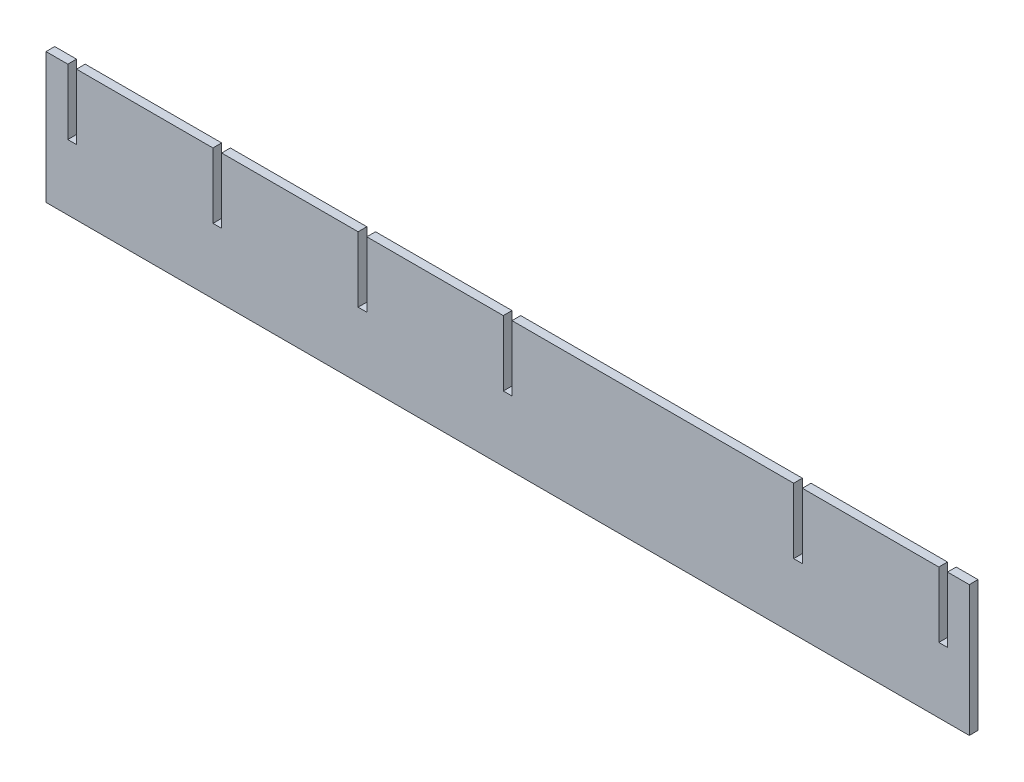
ISO-10303-21;
HEADER;
FILE_DESCRIPTION(('STEP AP214'),'2;1');
FILE_NAME('part.step','',(''),(''),'','','');
FILE_SCHEMA(('AUTOMOTIVE_DESIGN { 1 0 10303 214 1 1 1 1 }'));
ENDSEC;
DATA;
#1=APPLICATION_CONTEXT('core data for automotive mechanical design processes');
#2=APPLICATION_PROTOCOL_DEFINITION('international standard','automotive_design',2000,#1);
#3=PRODUCT_CONTEXT('',#1,'mechanical');
#4=PRODUCT('Part','Part','',(#3));
#5=PRODUCT_RELATED_PRODUCT_CATEGORY('part','',(#4));
#6=PRODUCT_DEFINITION_FORMATION('','',#4);
#7=PRODUCT_DEFINITION_CONTEXT('part definition',#1,'design');
#8=PRODUCT_DEFINITION('design','',#6,#7);
#9=PRODUCT_DEFINITION_SHAPE('','',#8);
#10=(LENGTH_UNIT() NAMED_UNIT(*) SI_UNIT(.MILLI.,.METRE.));
#11=(NAMED_UNIT(*) PLANE_ANGLE_UNIT() SI_UNIT($,.RADIAN.));
#12=(NAMED_UNIT(*) SI_UNIT($,.STERADIAN.) SOLID_ANGLE_UNIT());
#13=UNCERTAINTY_MEASURE_WITH_UNIT(LENGTH_MEASURE(1.E-05),#10,'distance_accuracy_value','');
#14=(GEOMETRIC_REPRESENTATION_CONTEXT(3) GLOBAL_UNCERTAINTY_ASSIGNED_CONTEXT((#13)) GLOBAL_UNIT_ASSIGNED_CONTEXT((#10,
#11,#12)) REPRESENTATION_CONTEXT('',''));
#15=CARTESIAN_POINT('',(0.,0.,0.));
#16=DIRECTION('',(0.,0.,1.));
#17=DIRECTION('',(1.,0.,0.));
#18=AXIS2_PLACEMENT_3D('',#15,#16,#17);
#19=CARTESIAN_POINT('',(0.,90.,12.));
#20=DIRECTION('',(0.,1.,0.));
#21=DIRECTION('',(-1.,0.,0.));
#22=AXIS2_PLACEMENT_3D('',#19,#20,#21);
#23=PLANE('',#22);
#24=DIRECTION('',(1.,0.,0.));
#25=VECTOR('',#24,1.);
#26=CARTESIAN_POINT('',(0.,90.,0.));
#27=LINE('',#26,#25);
#28=CARTESIAN_POINT('',(-594.,90.,0.));
#29=VERTEX_POINT('',#28);
#30=CARTESIAN_POINT('',(-406.,90.,0.));
#31=VERTEX_POINT('',#30);
#32=EDGE_CURVE('E271',#29,#31,#27,.T.);
#33=ORIENTED_EDGE('',*,*,#32,.F.);
#34=DIRECTION('',(0.,0.,-1.));
#35=VECTOR('',#34,1.);
#36=CARTESIAN_POINT('',(-594.,90.,12.));
#37=LINE('',#36,#35);
#38=CARTESIAN_POINT('',(-594.,90.,12.));
#39=VERTEX_POINT('',#38);
#40=EDGE_CURVE('E11',#39,#29,#37,.T.);
#41=ORIENTED_EDGE('',*,*,#40,.F.);
#42=DIRECTION('',(1.,0.,0.));
#43=VECTOR('',#42,1.);
#44=CARTESIAN_POINT('',(0.,90.,12.));
#45=LINE('',#44,#43);
#46=CARTESIAN_POINT('',(-406.,90.,12.));
#47=VERTEX_POINT('',#46);
#48=EDGE_CURVE('E360',#39,#47,#45,.T.);
#49=ORIENTED_EDGE('',*,*,#48,.T.);
#50=DIRECTION('',(0.,0.,-1.));
#51=VECTOR('',#50,1.);
#52=CARTESIAN_POINT('',(-406.,90.,12.));
#53=LINE('',#52,#51);
#54=EDGE_CURVE('E67',#47,#31,#53,.T.);
#55=ORIENTED_EDGE('',*,*,#54,.T.);
#56=EDGE_LOOP('',(#33,#41,#49,#55));
#57=FACE_BOUND('',#56,.T.);
#58=ADVANCED_FACE('F49',(#57),#23,.T.);
#59=CARTESIAN_POINT('',(-594.,0.,12.));
#60=DIRECTION('',(1.,0.,0.));
#61=DIRECTION('',(0.,0.,-1.));
#62=AXIS2_PLACEMENT_3D('',#59,#60,#61);
#63=PLANE('',#62);
#64=DIRECTION('',(0.,-1.,0.));
#65=VECTOR('',#64,1.);
#66=CARTESIAN_POINT('',(-594.,0.,0.));
#67=LINE('',#66,#65);
#68=CARTESIAN_POINT('',(-594.,0.,0.));
#69=VERTEX_POINT('',#68);
#70=EDGE_CURVE('E274',#29,#69,#67,.T.);
#71=ORIENTED_EDGE('',*,*,#70,.T.);
#72=DIRECTION('',(0.,0.,-1.));
#73=VECTOR('',#72,1.);
#74=CARTESIAN_POINT('',(-594.,0.,12.));
#75=LINE('',#74,#73);
#76=CARTESIAN_POINT('',(-594.,0.,12.));
#77=VERTEX_POINT('',#76);
#78=EDGE_CURVE('E59',#77,#69,#75,.T.);
#79=ORIENTED_EDGE('',*,*,#78,.F.);
#80=DIRECTION('',(0.,-1.,0.));
#81=VECTOR('',#80,1.);
#82=CARTESIAN_POINT('',(-594.,0.,12.));
#83=LINE('',#82,#81);
#84=EDGE_CURVE('E457',#39,#77,#83,.T.);
#85=ORIENTED_EDGE('',*,*,#84,.F.);
#86=ORIENTED_EDGE('',*,*,#40,.T.);
#87=EDGE_LOOP('',(#71,#79,#85,#86));
#88=FACE_BOUND('',#87,.T.);
#89=ADVANCED_FACE('F51',(#88),#63,.F.);
#90=CARTESIAN_POINT('',(0.,0.,12.));
#91=DIRECTION('',(0.,1.,0.));
#92=DIRECTION('',(-1.,0.,0.));
#93=AXIS2_PLACEMENT_3D('',#90,#91,#92);
#94=PLANE('',#93);
#95=DIRECTION('',(1.,0.,0.));
#96=VECTOR('',#95,1.);
#97=CARTESIAN_POINT('',(0.,0.,0.));
#98=LINE('',#97,#96);
#99=CARTESIAN_POINT('',(-606.,0.,0.));
#100=VERTEX_POINT('',#99);
#101=EDGE_CURVE('E280',#100,#69,#98,.T.);
#102=ORIENTED_EDGE('',*,*,#101,.F.);
#103=DIRECTION('',(0.,0.,-1.));
#104=VECTOR('',#103,1.);
#105=CARTESIAN_POINT('',(-606.,0.,12.));
#106=LINE('',#105,#104);
#107=CARTESIAN_POINT('',(-606.,0.,12.));
#108=VERTEX_POINT('',#107);
#109=EDGE_CURVE('E431',#108,#100,#106,.T.);
#110=ORIENTED_EDGE('',*,*,#109,.F.);
#111=DIRECTION('',(1.,0.,0.));
#112=VECTOR('',#111,1.);
#113=CARTESIAN_POINT('',(0.,0.,12.));
#114=LINE('',#113,#112);
#115=EDGE_CURVE('E442',#108,#77,#114,.T.);
#116=ORIENTED_EDGE('',*,*,#115,.T.);
#117=ORIENTED_EDGE('',*,*,#78,.T.);
#118=EDGE_LOOP('',(#102,#110,#116,#117));
#119=FACE_BOUND('',#118,.T.);
#120=ADVANCED_FACE('F440',(#119),#94,.T.);
#121=CARTESIAN_POINT('',(-606.,0.,12.));
#122=DIRECTION('',(1.,0.,0.));
#123=DIRECTION('',(0.,0.,-1.));
#124=AXIS2_PLACEMENT_3D('',#121,#122,#123);
#125=PLANE('',#124);
#126=DIRECTION('',(0.,-1.,0.));
#127=VECTOR('',#126,1.);
#128=CARTESIAN_POINT('',(-606.,0.,0.));
#129=LINE('',#128,#127);
#130=CARTESIAN_POINT('',(-606.,90.,0.));
#131=VERTEX_POINT('',#130);
#132=EDGE_CURVE('E284',#131,#100,#129,.T.);
#133=ORIENTED_EDGE('',*,*,#132,.F.);
#134=DIRECTION('',(0.,0.,-1.));
#135=VECTOR('',#134,1.);
#136=CARTESIAN_POINT('',(-606.,90.,12.));
#137=LINE('',#136,#135);
#138=CARTESIAN_POINT('',(-606.,90.,12.));
#139=VERTEX_POINT('',#138);
#140=EDGE_CURVE('E428',#139,#131,#137,.T.);
#141=ORIENTED_EDGE('',*,*,#140,.F.);
#142=DIRECTION('',(0.,-1.,0.));
#143=VECTOR('',#142,1.);
#144=CARTESIAN_POINT('',(-606.,0.,12.));
#145=LINE('',#144,#143);
#146=EDGE_CURVE('E454',#139,#108,#145,.T.);
#147=ORIENTED_EDGE('',*,*,#146,.T.);
#148=ORIENTED_EDGE('',*,*,#109,.T.);
#149=EDGE_LOOP('',(#133,#141,#147,#148));
#150=FACE_BOUND('',#149,.T.);
#151=ADVANCED_FACE('F451',(#150),#125,.T.);
#152=CARTESIAN_POINT('',(-636.,90.,0.));
#153=VERTEX_POINT('',#152);
#154=EDGE_CURVE('E276',#153,#131,#27,.T.);
#155=ORIENTED_EDGE('',*,*,#154,.F.);
#156=DIRECTION('',(0.,0.,-1.));
#157=VECTOR('',#156,1.);
#158=CARTESIAN_POINT('',(-636.,90.,12.));
#159=LINE('',#158,#157);
#160=CARTESIAN_POINT('',(-636.,90.,12.));
#161=VERTEX_POINT('',#160);
#162=EDGE_CURVE('E425',#161,#153,#159,.T.);
#163=ORIENTED_EDGE('',*,*,#162,.F.);
#164=EDGE_CURVE('E464',#161,#139,#45,.T.);
#165=ORIENTED_EDGE('',*,*,#164,.T.);
#166=ORIENTED_EDGE('',*,*,#140,.T.);
#167=EDGE_LOOP('',(#155,#163,#165,#166));
#168=FACE_BOUND('',#167,.T.);
#169=ADVANCED_FACE('F621',(#168),#23,.T.);
#170=CARTESIAN_POINT('',(-636.,0.,12.));
#171=DIRECTION('',(-1.,0.,0.));
#172=DIRECTION('',(0.,0.,1.));
#173=AXIS2_PLACEMENT_3D('',#170,#171,#172);
#174=PLANE('',#173);
#175=DIRECTION('',(0.,1.,0.));
#176=VECTOR('',#175,1.);
#177=CARTESIAN_POINT('',(-636.,0.,0.));
#178=LINE('',#177,#176);
#179=CARTESIAN_POINT('',(-636.,-90.0000000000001,0.));
#180=VERTEX_POINT('',#179);
#181=EDGE_CURVE('E288',#180,#153,#178,.T.);
#182=ORIENTED_EDGE('',*,*,#181,.F.);
#183=DIRECTION('',(0.,0.,-1.));
#184=VECTOR('',#183,1.);
#185=CARTESIAN_POINT('',(-636.,-90.0000000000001,12.));
#186=LINE('',#185,#184);
#187=CARTESIAN_POINT('',(-636.,-90.0000000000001,12.));
#188=VERTEX_POINT('',#187);
#189=EDGE_CURVE('E422',#188,#180,#186,.T.);
#190=ORIENTED_EDGE('',*,*,#189,.F.);
#191=DIRECTION('',(0.,1.,0.));
#192=VECTOR('',#191,1.);
#193=CARTESIAN_POINT('',(-636.,0.,12.));
#194=LINE('',#193,#192);
#195=EDGE_CURVE('E469',#188,#161,#194,.T.);
#196=ORIENTED_EDGE('',*,*,#195,.T.);
#197=ORIENTED_EDGE('',*,*,#162,.T.);
#198=EDGE_LOOP('',(#182,#190,#196,#197));
#199=FACE_BOUND('',#198,.T.);
#200=ADVANCED_FACE('F628',(#199),#174,.T.);
#201=CARTESIAN_POINT('',(0.,-90.,12.));
#202=DIRECTION('',(0.,1.,0.));
#203=DIRECTION('',(-1.,0.,0.));
#204=AXIS2_PLACEMENT_3D('',#201,#202,#203);
#205=PLANE('',#204);
#206=DIRECTION('',(1.,0.,0.));
#207=VECTOR('',#206,1.);
#208=CARTESIAN_POINT('',(0.,-90.,0.));
#209=LINE('',#208,#207);
#210=CARTESIAN_POINT('',(636.,-89.9999999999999,0.));
#211=VERTEX_POINT('',#210);
#212=EDGE_CURVE('E292',#180,#211,#209,.T.);
#213=ORIENTED_EDGE('',*,*,#212,.T.);
#214=DIRECTION('',(0.,0.,-1.));
#215=VECTOR('',#214,1.);
#216=CARTESIAN_POINT('',(636.,-89.9999999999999,12.));
#217=LINE('',#216,#215);
#218=CARTESIAN_POINT('',(636.,-89.9999999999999,12.));
#219=VERTEX_POINT('',#218);
#220=EDGE_CURVE('E418',#219,#211,#217,.T.);
#221=ORIENTED_EDGE('',*,*,#220,.F.);
#222=DIRECTION('',(1.,0.,0.));
#223=VECTOR('',#222,1.);
#224=CARTESIAN_POINT('',(0.,-90.,12.));
#225=LINE('',#224,#223);
#226=EDGE_CURVE('E473',#188,#219,#225,.T.);
#227=ORIENTED_EDGE('',*,*,#226,.F.);
#228=ORIENTED_EDGE('',*,*,#189,.T.);
#229=EDGE_LOOP('',(#213,#221,#227,#228));
#230=FACE_BOUND('',#229,.T.);
#231=ADVANCED_FACE('F799',(#230),#205,.F.);
#232=CARTESIAN_POINT('',(636.,0.,12.));
#233=DIRECTION('',(-1.,0.,0.));
#234=DIRECTION('',(0.,0.,1.));
#235=AXIS2_PLACEMENT_3D('',#232,#233,#234);
#236=PLANE('',#235);
#237=DIRECTION('',(0.,1.,0.));
#238=VECTOR('',#237,1.);
#239=CARTESIAN_POINT('',(636.,0.,0.));
#240=LINE('',#239,#238);
#241=CARTESIAN_POINT('',(636.,90.0000000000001,0.));
#242=VERTEX_POINT('',#241);
#243=EDGE_CURVE('E295',#211,#242,#240,.T.);
#244=ORIENTED_EDGE('',*,*,#243,.T.);
#245=DIRECTION('',(0.,0.,-1.));
#246=VECTOR('',#245,1.);
#247=CARTESIAN_POINT('',(636.,90.0000000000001,12.));
#248=LINE('',#247,#246);
#249=CARTESIAN_POINT('',(636.,90.0000000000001,12.));
#250=VERTEX_POINT('',#249);
#251=EDGE_CURVE('E415',#250,#242,#248,.T.);
#252=ORIENTED_EDGE('',*,*,#251,.F.);
#253=DIRECTION('',(0.,1.,0.));
#254=VECTOR('',#253,1.);
#255=CARTESIAN_POINT('',(636.,0.,12.));
#256=LINE('',#255,#254);
#257=EDGE_CURVE('E476',#219,#250,#256,.T.);
#258=ORIENTED_EDGE('',*,*,#257,.F.);
#259=ORIENTED_EDGE('',*,*,#220,.T.);
#260=EDGE_LOOP('',(#244,#252,#258,#259));
#261=FACE_BOUND('',#260,.T.);
#262=ADVANCED_FACE('F792',(#261),#236,.F.);
#263=CARTESIAN_POINT('',(606.,90.0000000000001,0.));
#264=VERTEX_POINT('',#263);
#265=EDGE_CURVE('E299',#264,#242,#27,.T.);
#266=ORIENTED_EDGE('',*,*,#265,.F.);
#267=DIRECTION('',(0.,0.,-1.));
#268=VECTOR('',#267,1.);
#269=CARTESIAN_POINT('',(606.,90.0000000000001,12.));
#270=LINE('',#269,#268);
#271=CARTESIAN_POINT('',(606.,90.0000000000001,12.));
#272=VERTEX_POINT('',#271);
#273=EDGE_CURVE('E412',#272,#264,#270,.T.);
#274=ORIENTED_EDGE('',*,*,#273,.F.);
#275=EDGE_CURVE('E479',#272,#250,#45,.T.);
#276=ORIENTED_EDGE('',*,*,#275,.T.);
#277=ORIENTED_EDGE('',*,*,#251,.T.);
#278=EDGE_LOOP('',(#266,#274,#276,#277));
#279=FACE_BOUND('',#278,.T.);
#280=ADVANCED_FACE('F629',(#279),#23,.T.);
#281=CARTESIAN_POINT('',(606.,0.,12.));
#282=DIRECTION('',(1.,0.,0.));
#283=DIRECTION('',(0.,0.,-1.));
#284=AXIS2_PLACEMENT_3D('',#281,#282,#283);
#285=PLANE('',#284);
#286=DIRECTION('',(0.,-1.,0.));
#287=VECTOR('',#286,1.);
#288=CARTESIAN_POINT('',(606.,0.,0.));
#289=LINE('',#288,#287);
#290=CARTESIAN_POINT('',(606.,0.,0.));
#291=VERTEX_POINT('',#290);
#292=EDGE_CURVE('E300',#264,#291,#289,.T.);
#293=ORIENTED_EDGE('',*,*,#292,.T.);
#294=DIRECTION('',(0.,0.,-1.));
#295=VECTOR('',#294,1.);
#296=CARTESIAN_POINT('',(606.,0.,12.));
#297=LINE('',#296,#295);
#298=CARTESIAN_POINT('',(606.,0.,12.));
#299=VERTEX_POINT('',#298);
#300=EDGE_CURVE('E409',#299,#291,#297,.T.);
#301=ORIENTED_EDGE('',*,*,#300,.F.);
#302=DIRECTION('',(0.,-1.,0.));
#303=VECTOR('',#302,1.);
#304=CARTESIAN_POINT('',(606.,0.,12.));
#305=LINE('',#304,#303);
#306=EDGE_CURVE('E480',#272,#299,#305,.T.);
#307=ORIENTED_EDGE('',*,*,#306,.F.);
#308=ORIENTED_EDGE('',*,*,#273,.T.);
#309=EDGE_LOOP('',(#293,#301,#307,#308));
#310=FACE_BOUND('',#309,.T.);
#311=ADVANCED_FACE('F775',(#310),#285,.F.);
#312=CARTESIAN_POINT('',(0.,0.,12.));
#313=DIRECTION('',(0.,1.,0.));
#314=DIRECTION('',(-1.,0.,0.));
#315=AXIS2_PLACEMENT_3D('',#312,#313,#314);
#316=PLANE('',#315);
#317=DIRECTION('',(1.,0.,0.));
#318=VECTOR('',#317,1.);
#319=CARTESIAN_POINT('',(0.,0.,0.));
#320=LINE('',#319,#318);
#321=CARTESIAN_POINT('',(594.,0.,0.));
#322=VERTEX_POINT('',#321);
#323=EDGE_CURVE('E304',#322,#291,#320,.T.);
#324=ORIENTED_EDGE('',*,*,#323,.F.);
#325=DIRECTION('',(0.,0.,-1.));
#326=VECTOR('',#325,1.);
#327=CARTESIAN_POINT('',(594.,0.,12.));
#328=LINE('',#327,#326);
#329=CARTESIAN_POINT('',(594.,0.,12.));
#330=VERTEX_POINT('',#329);
#331=EDGE_CURVE('E406',#330,#322,#328,.T.);
#332=ORIENTED_EDGE('',*,*,#331,.F.);
#333=DIRECTION('',(1.,0.,0.));
#334=VECTOR('',#333,1.);
#335=CARTESIAN_POINT('',(0.,0.,12.));
#336=LINE('',#335,#334);
#337=EDGE_CURVE('E483',#330,#299,#336,.T.);
#338=ORIENTED_EDGE('',*,*,#337,.T.);
#339=ORIENTED_EDGE('',*,*,#300,.T.);
#340=EDGE_LOOP('',(#324,#332,#338,#339));
#341=FACE_BOUND('',#340,.T.);
#342=ADVANCED_FACE('F766',(#341),#316,.T.);
#343=CARTESIAN_POINT('',(594.,0.,12.));
#344=DIRECTION('',(1.,0.,0.));
#345=DIRECTION('',(0.,0.,-1.));
#346=AXIS2_PLACEMENT_3D('',#343,#344,#345);
#347=PLANE('',#346);
#348=DIRECTION('',(0.,-1.,0.));
#349=VECTOR('',#348,1.);
#350=CARTESIAN_POINT('',(594.,0.,0.));
#351=LINE('',#350,#349);
#352=CARTESIAN_POINT('',(594.,90.0000000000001,0.));
#353=VERTEX_POINT('',#352);
#354=EDGE_CURVE('E308',#353,#322,#351,.T.);
#355=ORIENTED_EDGE('',*,*,#354,.F.);
#356=DIRECTION('',(0.,0.,-1.));
#357=VECTOR('',#356,1.);
#358=CARTESIAN_POINT('',(594.,90.0000000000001,12.));
#359=LINE('',#358,#357);
#360=CARTESIAN_POINT('',(594.,90.0000000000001,12.));
#361=VERTEX_POINT('',#360);
#362=EDGE_CURVE('E403',#361,#353,#359,.T.);
#363=ORIENTED_EDGE('',*,*,#362,.F.);
#364=DIRECTION('',(0.,-1.,0.));
#365=VECTOR('',#364,1.);
#366=CARTESIAN_POINT('',(594.,0.,12.));
#367=LINE('',#366,#365);
#368=EDGE_CURVE('E487',#361,#330,#367,.T.);
#369=ORIENTED_EDGE('',*,*,#368,.T.);
#370=ORIENTED_EDGE('',*,*,#331,.T.);
#371=EDGE_LOOP('',(#355,#363,#369,#370));
#372=FACE_BOUND('',#371,.T.);
#373=ADVANCED_FACE('F759',(#372),#347,.T.);
#374=CARTESIAN_POINT('',(406.,90.0000000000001,0.));
#375=VERTEX_POINT('',#374);
#376=EDGE_CURVE('E312',#375,#353,#27,.T.);
#377=ORIENTED_EDGE('',*,*,#376,.F.);
#378=DIRECTION('',(0.,0.,-1.));
#379=VECTOR('',#378,1.);
#380=CARTESIAN_POINT('',(406.,90.0000000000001,12.));
#381=LINE('',#380,#379);
#382=CARTESIAN_POINT('',(406.,90.0000000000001,12.));
#383=VERTEX_POINT('',#382);
#384=EDGE_CURVE('E400',#383,#375,#381,.T.);
#385=ORIENTED_EDGE('',*,*,#384,.F.);
#386=EDGE_CURVE('E491',#383,#361,#45,.T.);
#387=ORIENTED_EDGE('',*,*,#386,.T.);
#388=ORIENTED_EDGE('',*,*,#362,.T.);
#389=EDGE_LOOP('',(#377,#385,#387,#388));
#390=FACE_BOUND('',#389,.T.);
#391=ADVANCED_FACE('F618',(#390),#23,.T.);
#392=CARTESIAN_POINT('',(406.,0.,12.));
#393=DIRECTION('',(1.,0.,0.));
#394=DIRECTION('',(0.,0.,-1.));
#395=AXIS2_PLACEMENT_3D('',#392,#393,#394);
#396=PLANE('',#395);
#397=DIRECTION('',(0.,-1.,0.));
#398=VECTOR('',#397,1.);
#399=CARTESIAN_POINT('',(406.,0.,0.));
#400=LINE('',#399,#398);
#401=CARTESIAN_POINT('',(406.,0.,0.));
#402=VERTEX_POINT('',#401);
#403=EDGE_CURVE('E313',#375,#402,#400,.T.);
#404=ORIENTED_EDGE('',*,*,#403,.T.);
#405=DIRECTION('',(0.,0.,-1.));
#406=VECTOR('',#405,1.);
#407=CARTESIAN_POINT('',(406.,0.,12.));
#408=LINE('',#407,#406);
#409=CARTESIAN_POINT('',(406.,0.,12.));
#410=VERTEX_POINT('',#409);
#411=EDGE_CURVE('E397',#410,#402,#408,.T.);
#412=ORIENTED_EDGE('',*,*,#411,.F.);
#413=DIRECTION('',(0.,-1.,0.));
#414=VECTOR('',#413,1.);
#415=CARTESIAN_POINT('',(406.,0.,12.));
#416=LINE('',#415,#414);
#417=EDGE_CURVE('E492',#383,#410,#416,.T.);
#418=ORIENTED_EDGE('',*,*,#417,.F.);
#419=ORIENTED_EDGE('',*,*,#384,.T.);
#420=EDGE_LOOP('',(#404,#412,#418,#419));
#421=FACE_BOUND('',#420,.T.);
#422=ADVANCED_FACE('F742',(#421),#396,.F.);
#423=CARTESIAN_POINT('',(0.,0.,12.));
#424=DIRECTION('',(0.,1.,0.));
#425=DIRECTION('',(-1.,0.,0.));
#426=AXIS2_PLACEMENT_3D('',#423,#424,#425);
#427=PLANE('',#426);
#428=DIRECTION('',(1.,0.,0.));
#429=VECTOR('',#428,1.);
#430=CARTESIAN_POINT('',(0.,0.,0.));
#431=LINE('',#430,#429);
#432=CARTESIAN_POINT('',(394.,0.,0.));
#433=VERTEX_POINT('',#432);
#434=EDGE_CURVE('E317',#433,#402,#431,.T.);
#435=ORIENTED_EDGE('',*,*,#434,.F.);
#436=DIRECTION('',(0.,0.,-1.));
#437=VECTOR('',#436,1.);
#438=CARTESIAN_POINT('',(394.,0.,12.));
#439=LINE('',#438,#437);
#440=CARTESIAN_POINT('',(394.,0.,12.));
#441=VERTEX_POINT('',#440);
#442=EDGE_CURVE('E394',#441,#433,#439,.T.);
#443=ORIENTED_EDGE('',*,*,#442,.F.);
#444=DIRECTION('',(1.,0.,0.));
#445=VECTOR('',#444,1.);
#446=CARTESIAN_POINT('',(0.,0.,12.));
#447=LINE('',#446,#445);
#448=EDGE_CURVE('E495',#441,#410,#447,.T.);
#449=ORIENTED_EDGE('',*,*,#448,.T.);
#450=ORIENTED_EDGE('',*,*,#411,.T.);
#451=EDGE_LOOP('',(#435,#443,#449,#450));
#452=FACE_BOUND('',#451,.T.);
#453=ADVANCED_FACE('F735',(#452),#427,.T.);
#454=CARTESIAN_POINT('',(394.,0.,12.));
#455=DIRECTION('',(1.,0.,0.));
#456=DIRECTION('',(0.,0.,-1.));
#457=AXIS2_PLACEMENT_3D('',#454,#455,#456);
#458=PLANE('',#457);
#459=DIRECTION('',(0.,-1.,0.));
#460=VECTOR('',#459,1.);
#461=CARTESIAN_POINT('',(394.,0.,0.));
#462=LINE('',#461,#460);
#463=CARTESIAN_POINT('',(394.,90.0000000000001,0.));
#464=VERTEX_POINT('',#463);
#465=EDGE_CURVE('E321',#464,#433,#462,.T.);
#466=ORIENTED_EDGE('',*,*,#465,.F.);
#467=DIRECTION('',(0.,0.,-1.));
#468=VECTOR('',#467,1.);
#469=CARTESIAN_POINT('',(394.,90.0000000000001,12.));
#470=LINE('',#469,#468);
#471=CARTESIAN_POINT('',(394.,90.0000000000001,12.));
#472=VERTEX_POINT('',#471);
#473=EDGE_CURVE('E391',#472,#464,#470,.T.);
#474=ORIENTED_EDGE('',*,*,#473,.F.);
#475=DIRECTION('',(0.,-1.,0.));
#476=VECTOR('',#475,1.);
#477=CARTESIAN_POINT('',(394.,0.,12.));
#478=LINE('',#477,#476);
#479=EDGE_CURVE('E499',#472,#441,#478,.T.);
#480=ORIENTED_EDGE('',*,*,#479,.T.);
#481=ORIENTED_EDGE('',*,*,#442,.T.);
#482=EDGE_LOOP('',(#466,#474,#480,#481));
#483=FACE_BOUND('',#482,.T.);
#484=ADVANCED_FACE('F568',(#483),#458,.T.);
#485=CARTESIAN_POINT('',(5.99999999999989,90.,0.));
#486=VERTEX_POINT('',#485);
#487=EDGE_CURVE('E325',#486,#464,#27,.T.);
#488=ORIENTED_EDGE('',*,*,#487,.F.);
#489=DIRECTION('',(0.,0.,-1.));
#490=VECTOR('',#489,1.);
#491=CARTESIAN_POINT('',(5.99999999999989,90.,12.));
#492=LINE('',#491,#490);
#493=CARTESIAN_POINT('',(5.99999999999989,90.,12.));
#494=VERTEX_POINT('',#493);
#495=EDGE_CURVE('E388',#494,#486,#492,.T.);
#496=ORIENTED_EDGE('',*,*,#495,.F.);
#497=EDGE_CURVE('E503',#494,#472,#45,.T.);
#498=ORIENTED_EDGE('',*,*,#497,.T.);
#499=ORIENTED_EDGE('',*,*,#473,.T.);
#500=EDGE_LOOP('',(#488,#496,#498,#499));
#501=FACE_BOUND('',#500,.T.);
#502=ADVANCED_FACE('F560',(#501),#23,.T.);
#503=CARTESIAN_POINT('',(5.99999999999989,0.,12.));
#504=DIRECTION('',(1.,0.,0.));
#505=DIRECTION('',(0.,0.,-1.));
#506=AXIS2_PLACEMENT_3D('',#503,#504,#505);
#507=PLANE('',#506);
#508=DIRECTION('',(0.,-1.,0.));
#509=VECTOR('',#508,1.);
#510=CARTESIAN_POINT('',(5.99999999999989,0.,0.));
#511=LINE('',#510,#509);
#512=CARTESIAN_POINT('',(5.99999999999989,0.,0.));
#513=VERTEX_POINT('',#512);
#514=EDGE_CURVE('E326',#486,#513,#511,.T.);
#515=ORIENTED_EDGE('',*,*,#514,.T.);
#516=DIRECTION('',(0.,0.,-1.));
#517=VECTOR('',#516,1.);
#518=CARTESIAN_POINT('',(5.99999999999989,0.,12.));
#519=LINE('',#518,#517);
#520=CARTESIAN_POINT('',(5.99999999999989,0.,12.));
#521=VERTEX_POINT('',#520);
#522=EDGE_CURVE('E385',#521,#513,#519,.T.);
#523=ORIENTED_EDGE('',*,*,#522,.F.);
#524=DIRECTION('',(0.,-1.,0.));
#525=VECTOR('',#524,1.);
#526=CARTESIAN_POINT('',(5.99999999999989,0.,12.));
#527=LINE('',#526,#525);
#528=EDGE_CURVE('E504',#494,#521,#527,.T.);
#529=ORIENTED_EDGE('',*,*,#528,.F.);
#530=ORIENTED_EDGE('',*,*,#495,.T.);
#531=EDGE_LOOP('',(#515,#523,#529,#530));
#532=FACE_BOUND('',#531,.T.);
#533=ADVANCED_FACE('F609',(#532),#507,.F.);
#534=CARTESIAN_POINT('',(0.,0.,12.));
#535=DIRECTION('',(0.,1.,0.));
#536=DIRECTION('',(-1.,0.,0.));
#537=AXIS2_PLACEMENT_3D('',#534,#535,#536);
#538=PLANE('',#537);
#539=DIRECTION('',(1.,0.,0.));
#540=VECTOR('',#539,1.);
#541=CARTESIAN_POINT('',(0.,0.,0.));
#542=LINE('',#541,#540);
#543=CARTESIAN_POINT('',(-6.00000000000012,0.,0.));
#544=VERTEX_POINT('',#543);
#545=EDGE_CURVE('E330',#544,#513,#542,.T.);
#546=ORIENTED_EDGE('',*,*,#545,.F.);
#547=DIRECTION('',(0.,0.,-1.));
#548=VECTOR('',#547,1.);
#549=CARTESIAN_POINT('',(-6.00000000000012,0.,12.));
#550=LINE('',#549,#548);
#551=CARTESIAN_POINT('',(-6.00000000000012,0.,12.));
#552=VERTEX_POINT('',#551);
#553=EDGE_CURVE('E382',#552,#544,#550,.T.);
#554=ORIENTED_EDGE('',*,*,#553,.F.);
#555=DIRECTION('',(1.,0.,0.));
#556=VECTOR('',#555,1.);
#557=CARTESIAN_POINT('',(0.,0.,12.));
#558=LINE('',#557,#556);
#559=EDGE_CURVE('E507',#552,#521,#558,.T.);
#560=ORIENTED_EDGE('',*,*,#559,.T.);
#561=ORIENTED_EDGE('',*,*,#522,.T.);
#562=EDGE_LOOP('',(#546,#554,#560,#561));
#563=FACE_BOUND('',#562,.T.);
#564=ADVANCED_FACE('F607',(#563),#538,.T.);
#565=CARTESIAN_POINT('',(-6.00000000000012,0.,12.));
#566=DIRECTION('',(1.,0.,0.));
#567=DIRECTION('',(0.,0.,-1.));
#568=AXIS2_PLACEMENT_3D('',#565,#566,#567);
#569=PLANE('',#568);
#570=DIRECTION('',(0.,-1.,0.));
#571=VECTOR('',#570,1.);
#572=CARTESIAN_POINT('',(-6.00000000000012,0.,0.));
#573=LINE('',#572,#571);
#574=CARTESIAN_POINT('',(-6.00000000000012,90.,0.));
#575=VERTEX_POINT('',#574);
#576=EDGE_CURVE('E334',#575,#544,#573,.T.);
#577=ORIENTED_EDGE('',*,*,#576,.F.);
#578=DIRECTION('',(0.,0.,-1.));
#579=VECTOR('',#578,1.);
#580=CARTESIAN_POINT('',(-6.00000000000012,90.,12.));
#581=LINE('',#580,#579);
#582=CARTESIAN_POINT('',(-6.00000000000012,90.,12.));
#583=VERTEX_POINT('',#582);
#584=EDGE_CURVE('E379',#583,#575,#581,.T.);
#585=ORIENTED_EDGE('',*,*,#584,.F.);
#586=DIRECTION('',(0.,-1.,0.));
#587=VECTOR('',#586,1.);
#588=CARTESIAN_POINT('',(-6.00000000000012,0.,12.));
#589=LINE('',#588,#587);
#590=EDGE_CURVE('E511',#583,#552,#589,.T.);
#591=ORIENTED_EDGE('',*,*,#590,.T.);
#592=ORIENTED_EDGE('',*,*,#553,.T.);
#593=EDGE_LOOP('',(#577,#585,#591,#592));
#594=FACE_BOUND('',#593,.T.);
#595=ADVANCED_FACE('F604',(#594),#569,.T.);
#596=CARTESIAN_POINT('',(-194.,90.,0.));
#597=VERTEX_POINT('',#596);
#598=EDGE_CURVE('E338',#597,#575,#27,.T.);
#599=ORIENTED_EDGE('',*,*,#598,.F.);
#600=DIRECTION('',(0.,0.,-1.));
#601=VECTOR('',#600,1.);
#602=CARTESIAN_POINT('',(-194.,90.,12.));
#603=LINE('',#602,#601);
#604=CARTESIAN_POINT('',(-194.,90.,12.));
#605=VERTEX_POINT('',#604);
#606=EDGE_CURVE('E376',#605,#597,#603,.T.);
#607=ORIENTED_EDGE('',*,*,#606,.F.);
#608=EDGE_CURVE('E515',#605,#583,#45,.T.);
#609=ORIENTED_EDGE('',*,*,#608,.T.);
#610=ORIENTED_EDGE('',*,*,#584,.T.);
#611=EDGE_LOOP('',(#599,#607,#609,#610));
#612=FACE_BOUND('',#611,.T.);
#613=ADVANCED_FACE('F598',(#612),#23,.T.);
#614=CARTESIAN_POINT('',(-194.,0.,12.));
#615=DIRECTION('',(1.,0.,0.));
#616=DIRECTION('',(0.,0.,-1.));
#617=AXIS2_PLACEMENT_3D('',#614,#615,#616);
#618=PLANE('',#617);
#619=DIRECTION('',(0.,-1.,0.));
#620=VECTOR('',#619,1.);
#621=CARTESIAN_POINT('',(-194.,0.,0.));
#622=LINE('',#621,#620);
#623=CARTESIAN_POINT('',(-194.,0.,0.));
#624=VERTEX_POINT('',#623);
#625=EDGE_CURVE('E339',#597,#624,#622,.T.);
#626=ORIENTED_EDGE('',*,*,#625,.T.);
#627=DIRECTION('',(0.,0.,-1.));
#628=VECTOR('',#627,1.);
#629=CARTESIAN_POINT('',(-194.,0.,12.));
#630=LINE('',#629,#628);
#631=CARTESIAN_POINT('',(-194.,0.,12.));
#632=VERTEX_POINT('',#631);
#633=EDGE_CURVE('E373',#632,#624,#630,.T.);
#634=ORIENTED_EDGE('',*,*,#633,.F.);
#635=DIRECTION('',(0.,-1.,0.));
#636=VECTOR('',#635,1.);
#637=CARTESIAN_POINT('',(-194.,0.,12.));
#638=LINE('',#637,#636);
#639=EDGE_CURVE('E516',#605,#632,#638,.T.);
#640=ORIENTED_EDGE('',*,*,#639,.F.);
#641=ORIENTED_EDGE('',*,*,#606,.T.);
#642=EDGE_LOOP('',(#626,#634,#640,#641));
#643=FACE_BOUND('',#642,.T.);
#644=ADVANCED_FACE('F636',(#643),#618,.F.);
#645=CARTESIAN_POINT('',(0.,0.,12.));
#646=DIRECTION('',(0.,1.,0.));
#647=DIRECTION('',(-1.,0.,0.));
#648=AXIS2_PLACEMENT_3D('',#645,#646,#647);
#649=PLANE('',#648);
#650=DIRECTION('',(1.,0.,0.));
#651=VECTOR('',#650,1.);
#652=CARTESIAN_POINT('',(0.,0.,0.));
#653=LINE('',#652,#651);
#654=CARTESIAN_POINT('',(-206.,0.,0.));
#655=VERTEX_POINT('',#654);
#656=EDGE_CURVE('E343',#655,#624,#653,.T.);
#657=ORIENTED_EDGE('',*,*,#656,.F.);
#658=DIRECTION('',(0.,0.,-1.));
#659=VECTOR('',#658,1.);
#660=CARTESIAN_POINT('',(-206.,0.,12.));
#661=LINE('',#660,#659);
#662=CARTESIAN_POINT('',(-206.,0.,12.));
#663=VERTEX_POINT('',#662);
#664=EDGE_CURVE('E370',#663,#655,#661,.T.);
#665=ORIENTED_EDGE('',*,*,#664,.F.);
#666=DIRECTION('',(1.,0.,0.));
#667=VECTOR('',#666,1.);
#668=CARTESIAN_POINT('',(0.,0.,12.));
#669=LINE('',#668,#667);
#670=EDGE_CURVE('E519',#663,#632,#669,.T.);
#671=ORIENTED_EDGE('',*,*,#670,.T.);
#672=ORIENTED_EDGE('',*,*,#633,.T.);
#673=EDGE_LOOP('',(#657,#665,#671,#672));
#674=FACE_BOUND('',#673,.T.);
#675=ADVANCED_FACE('F594',(#674),#649,.T.);
#676=CARTESIAN_POINT('',(-206.,0.,12.));
#677=DIRECTION('',(1.,0.,0.));
#678=DIRECTION('',(0.,0.,-1.));
#679=AXIS2_PLACEMENT_3D('',#676,#677,#678);
#680=PLANE('',#679);
#681=DIRECTION('',(0.,-1.,0.));
#682=VECTOR('',#681,1.);
#683=CARTESIAN_POINT('',(-206.,0.,0.));
#684=LINE('',#683,#682);
#685=CARTESIAN_POINT('',(-206.,90.,0.));
#686=VERTEX_POINT('',#685);
#687=EDGE_CURVE('E347',#686,#655,#684,.T.);
#688=ORIENTED_EDGE('',*,*,#687,.F.);
#689=DIRECTION('',(0.,0.,-1.));
#690=VECTOR('',#689,1.);
#691=CARTESIAN_POINT('',(-206.,90.,12.));
#692=LINE('',#691,#690);
#693=CARTESIAN_POINT('',(-206.,90.,12.));
#694=VERTEX_POINT('',#693);
#695=EDGE_CURVE('E367',#694,#686,#692,.T.);
#696=ORIENTED_EDGE('',*,*,#695,.F.);
#697=DIRECTION('',(0.,-1.,0.));
#698=VECTOR('',#697,1.);
#699=CARTESIAN_POINT('',(-206.,0.,12.));
#700=LINE('',#699,#698);
#701=EDGE_CURVE('E522',#694,#663,#700,.T.);
#702=ORIENTED_EDGE('',*,*,#701,.T.);
#703=ORIENTED_EDGE('',*,*,#664,.T.);
#704=EDGE_LOOP('',(#688,#696,#702,#703));
#705=FACE_BOUND('',#704,.T.);
#706=ADVANCED_FACE('F590',(#705),#680,.T.);
#707=CARTESIAN_POINT('',(-394.,90.,0.));
#708=VERTEX_POINT('',#707);
#709=EDGE_CURVE('E275',#708,#686,#27,.T.);
#710=ORIENTED_EDGE('',*,*,#709,.F.);
#711=DIRECTION('',(0.,0.,-1.));
#712=VECTOR('',#711,1.);
#713=CARTESIAN_POINT('',(-394.,90.,12.));
#714=LINE('',#713,#712);
#715=CARTESIAN_POINT('',(-394.,90.,12.));
#716=VERTEX_POINT('',#715);
#717=EDGE_CURVE('E259',#716,#708,#714,.T.);
#718=ORIENTED_EDGE('',*,*,#717,.F.);
#719=EDGE_CURVE('E247',#716,#694,#45,.T.);
#720=ORIENTED_EDGE('',*,*,#719,.T.);
#721=ORIENTED_EDGE('',*,*,#695,.T.);
#722=EDGE_LOOP('',(#710,#718,#720,#721));
#723=FACE_BOUND('',#722,.T.);
#724=ADVANCED_FACE('F589',(#723),#23,.T.);
#725=CARTESIAN_POINT('',(-394.,0.,12.));
#726=DIRECTION('',(1.,0.,0.));
#727=DIRECTION('',(0.,0.,-1.));
#728=AXIS2_PLACEMENT_3D('',#725,#726,#727);
#729=PLANE('',#728);
#730=DIRECTION('',(0.,-1.,0.));
#731=VECTOR('',#730,1.);
#732=CARTESIAN_POINT('',(-394.,0.,0.));
#733=LINE('',#732,#731);
#734=CARTESIAN_POINT('',(-394.,0.,0.));
#735=VERTEX_POINT('',#734);
#736=EDGE_CURVE('E255',#708,#735,#733,.T.);
#737=ORIENTED_EDGE('',*,*,#736,.T.);
#738=DIRECTION('',(0.,0.,-1.));
#739=VECTOR('',#738,1.);
#740=CARTESIAN_POINT('',(-394.,0.,12.));
#741=LINE('',#740,#739);
#742=CARTESIAN_POINT('',(-394.,0.,12.));
#743=VERTEX_POINT('',#742);
#744=EDGE_CURVE('E252',#743,#735,#741,.T.);
#745=ORIENTED_EDGE('',*,*,#744,.F.);
#746=DIRECTION('',(0.,-1.,0.));
#747=VECTOR('',#746,1.);
#748=CARTESIAN_POINT('',(-394.,0.,12.));
#749=LINE('',#748,#747);
#750=EDGE_CURVE('E238',#716,#743,#749,.T.);
#751=ORIENTED_EDGE('',*,*,#750,.F.);
#752=ORIENTED_EDGE('',*,*,#717,.T.);
#753=EDGE_LOOP('',(#737,#745,#751,#752));
#754=FACE_BOUND('',#753,.T.);
#755=ADVANCED_FACE('F253',(#754),#729,.F.);
#756=CARTESIAN_POINT('',(0.,0.,12.));
#757=DIRECTION('',(0.,1.,0.));
#758=DIRECTION('',(-1.,0.,0.));
#759=AXIS2_PLACEMENT_3D('',#756,#757,#758);
#760=PLANE('',#759);
#761=DIRECTION('',(1.,0.,0.));
#762=VECTOR('',#761,1.);
#763=CARTESIAN_POINT('',(0.,0.,0.));
#764=LINE('',#763,#762);
#765=CARTESIAN_POINT('',(-406.,0.,0.));
#766=VERTEX_POINT('',#765);
#767=EDGE_CURVE('E353',#766,#735,#764,.T.);
#768=ORIENTED_EDGE('',*,*,#767,.F.);
#769=DIRECTION('',(0.,0.,-1.));
#770=VECTOR('',#769,1.);
#771=CARTESIAN_POINT('',(-406.,0.,12.));
#772=LINE('',#771,#770);
#773=CARTESIAN_POINT('',(-406.,0.,12.));
#774=VERTEX_POINT('',#773);
#775=EDGE_CURVE('E152',#774,#766,#772,.T.);
#776=ORIENTED_EDGE('',*,*,#775,.F.);
#777=DIRECTION('',(1.,0.,0.));
#778=VECTOR('',#777,1.);
#779=CARTESIAN_POINT('',(0.,0.,12.));
#780=LINE('',#779,#778);
#781=EDGE_CURVE('E244',#774,#743,#780,.T.);
#782=ORIENTED_EDGE('',*,*,#781,.T.);
#783=ORIENTED_EDGE('',*,*,#744,.T.);
#784=EDGE_LOOP('',(#768,#776,#782,#783));
#785=FACE_BOUND('',#784,.T.);
#786=ADVANCED_FACE('F261',(#785),#760,.T.);
#787=CARTESIAN_POINT('',(-406.,0.,12.));
#788=DIRECTION('',(1.,0.,0.));
#789=DIRECTION('',(0.,0.,-1.));
#790=AXIS2_PLACEMENT_3D('',#787,#788,#789);
#791=PLANE('',#790);
#792=DIRECTION('',(0.,-1.,0.));
#793=VECTOR('',#792,1.);
#794=CARTESIAN_POINT('',(-406.,0.,0.));
#795=LINE('',#794,#793);
#796=EDGE_CURVE('E356',#31,#766,#795,.T.);
#797=ORIENTED_EDGE('',*,*,#796,.F.);
#798=ORIENTED_EDGE('',*,*,#54,.F.);
#799=DIRECTION('',(0.,-1.,0.));
#800=VECTOR('',#799,1.);
#801=CARTESIAN_POINT('',(-406.,0.,12.));
#802=LINE('',#801,#800);
#803=EDGE_CURVE('E263',#47,#774,#802,.T.);
#804=ORIENTED_EDGE('',*,*,#803,.T.);
#805=ORIENTED_EDGE('',*,*,#775,.T.);
#806=EDGE_LOOP('',(#797,#798,#804,#805));
#807=FACE_BOUND('',#806,.T.);
#808=ADVANCED_FACE('F676',(#807),#791,.T.);
#809=CARTESIAN_POINT('',(0.,0.,12.));
#810=DIRECTION('',(0.,0.,1.));
#811=DIRECTION('',(1.,0.,0.));
#812=AXIS2_PLACEMENT_3D('',#809,#810,#811);
#813=PLANE('',#812);
#814=ORIENTED_EDGE('',*,*,#48,.F.);
#815=ORIENTED_EDGE('',*,*,#84,.T.);
#816=ORIENTED_EDGE('',*,*,#115,.F.);
#817=ORIENTED_EDGE('',*,*,#146,.F.);
#818=ORIENTED_EDGE('',*,*,#164,.F.);
#819=ORIENTED_EDGE('',*,*,#195,.F.);
#820=ORIENTED_EDGE('',*,*,#226,.T.);
#821=ORIENTED_EDGE('',*,*,#257,.T.);
#822=ORIENTED_EDGE('',*,*,#275,.F.);
#823=ORIENTED_EDGE('',*,*,#306,.T.);
#824=ORIENTED_EDGE('',*,*,#337,.F.);
#825=ORIENTED_EDGE('',*,*,#368,.F.);
#826=ORIENTED_EDGE('',*,*,#386,.F.);
#827=ORIENTED_EDGE('',*,*,#417,.T.);
#828=ORIENTED_EDGE('',*,*,#448,.F.);
#829=ORIENTED_EDGE('',*,*,#479,.F.);
#830=ORIENTED_EDGE('',*,*,#497,.F.);
#831=ORIENTED_EDGE('',*,*,#528,.T.);
#832=ORIENTED_EDGE('',*,*,#559,.F.);
#833=ORIENTED_EDGE('',*,*,#590,.F.);
#834=ORIENTED_EDGE('',*,*,#608,.F.);
#835=ORIENTED_EDGE('',*,*,#639,.T.);
#836=ORIENTED_EDGE('',*,*,#670,.F.);
#837=ORIENTED_EDGE('',*,*,#701,.F.);
#838=ORIENTED_EDGE('',*,*,#719,.F.);
#839=ORIENTED_EDGE('',*,*,#750,.T.);
#840=ORIENTED_EDGE('',*,*,#781,.F.);
#841=ORIENTED_EDGE('',*,*,#803,.F.);
#842=EDGE_LOOP('',(#814,#815,#816,#817,#818,#819,#820,#821,#822,#823,#824,#825,#826,#827,#828,
#829,#830,#831,#832,#833,#834,#835,#836,#837,#838,#839,#840,#841));
#843=FACE_BOUND('',#842,.T.);
#844=ADVANCED_FACE('F241',(#843),#813,.T.);
#845=CARTESIAN_POINT('',(0.,0.,0.));
#846=DIRECTION('',(0.,0.,1.));
#847=DIRECTION('',(1.,0.,0.));
#848=AXIS2_PLACEMENT_3D('',#845,#846,#847);
#849=PLANE('',#848);
#850=ORIENTED_EDGE('',*,*,#32,.T.);
#851=ORIENTED_EDGE('',*,*,#796,.T.);
#852=ORIENTED_EDGE('',*,*,#767,.T.);
#853=ORIENTED_EDGE('',*,*,#736,.F.);
#854=ORIENTED_EDGE('',*,*,#709,.T.);
#855=ORIENTED_EDGE('',*,*,#687,.T.);
#856=ORIENTED_EDGE('',*,*,#656,.T.);
#857=ORIENTED_EDGE('',*,*,#625,.F.);
#858=ORIENTED_EDGE('',*,*,#598,.T.);
#859=ORIENTED_EDGE('',*,*,#576,.T.);
#860=ORIENTED_EDGE('',*,*,#545,.T.);
#861=ORIENTED_EDGE('',*,*,#514,.F.);
#862=ORIENTED_EDGE('',*,*,#487,.T.);
#863=ORIENTED_EDGE('',*,*,#465,.T.);
#864=ORIENTED_EDGE('',*,*,#434,.T.);
#865=ORIENTED_EDGE('',*,*,#403,.F.);
#866=ORIENTED_EDGE('',*,*,#376,.T.);
#867=ORIENTED_EDGE('',*,*,#354,.T.);
#868=ORIENTED_EDGE('',*,*,#323,.T.);
#869=ORIENTED_EDGE('',*,*,#292,.F.);
#870=ORIENTED_EDGE('',*,*,#265,.T.);
#871=ORIENTED_EDGE('',*,*,#243,.F.);
#872=ORIENTED_EDGE('',*,*,#212,.F.);
#873=ORIENTED_EDGE('',*,*,#181,.T.);
#874=ORIENTED_EDGE('',*,*,#154,.T.);
#875=ORIENTED_EDGE('',*,*,#132,.T.);
#876=ORIENTED_EDGE('',*,*,#101,.T.);
#877=ORIENTED_EDGE('',*,*,#70,.F.);
#878=EDGE_LOOP('',(#850,#851,#852,#853,#854,#855,#856,#857,#858,#859,#860,#861,#862,#863,#864,
#865,#866,#867,#868,#869,#870,#871,#872,#873,#874,#875,#876,#877));
#879=FACE_BOUND('',#878,.T.);
#880=ADVANCED_FACE('F446',(#879),#849,.F.);
#881=CLOSED_SHELL('',(#58,#89,#120,#151,#169,#200,#231,#262,#280,#311,#342,#373,#391,#422,#453,
#484,#502,#533,#564,#595,#613,#644,#675,#706,#724,#755,#786,#808,#844,#880));
#882=MANIFOLD_SOLID_BREP('B2',#881);
#883=ADVANCED_BREP_SHAPE_REPRESENTATION('',(#18,#882),#14);
#884=SHAPE_DEFINITION_REPRESENTATION(#9,#883);
ENDSEC;
END-ISO-10303-21;
